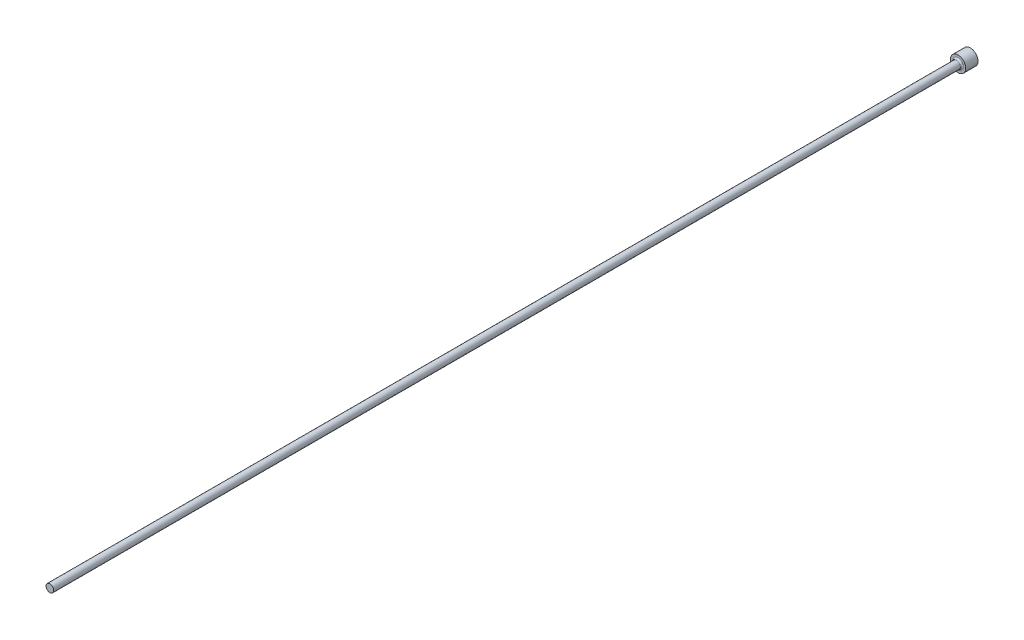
from build123d import *

# Parameters (mm, degrees)
FILLET1_R = 0.5


with BuildPart() as part:
    # FV → Revolve1 (revolve)
    with BuildSketch(Plane(origin=(0, 0, 0), x_dir=(1, 0, 0), z_dir=(0, 1, 0)), mode=Mode.PRIVATE) as revolve1_sk:
        Polygon((0, 0), (2.5, 0), (2.5, -4), (1.25, -4), (1.25, -300), (0, -300), align=None)
    revolve(revolve1_sk.sketch.rotate(Axis((0, 0, -9.033228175), (0, 0, 1)), 180), axis=Axis((0, 0, -9.033228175), (0, 0, 1)))

    # Fillet1
    fillet1_edges = [part.edges().sort_by_distance(p)[0] for p in [
        (1.25, 0, 4),
    ]]
    fillet(fillet1_edges, radius=FILLET1_R)


solid = part.part
